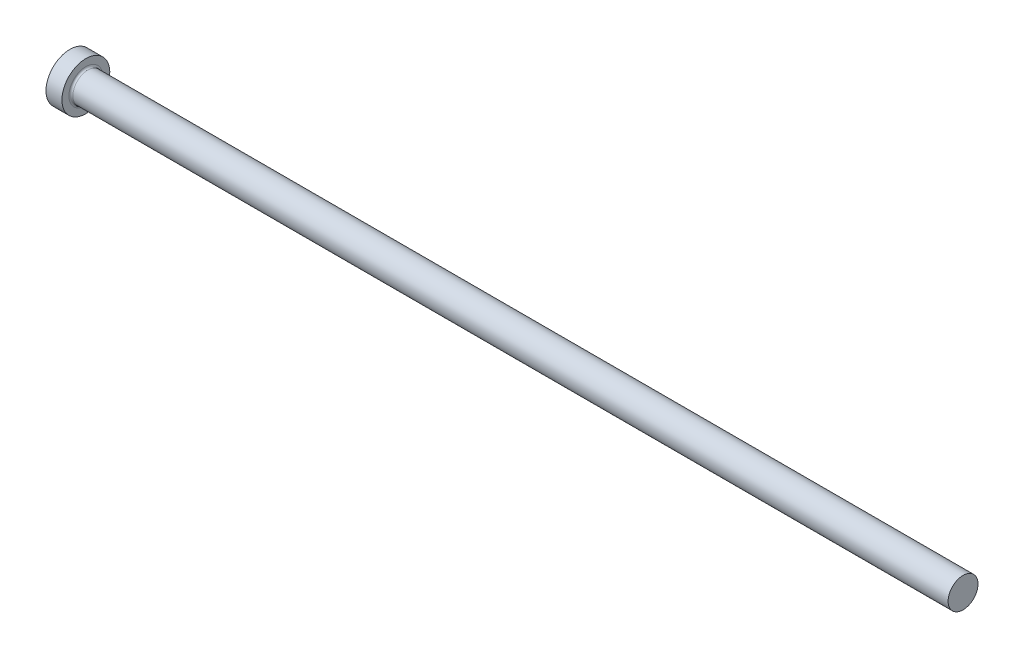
from build123d import *


with BuildPart() as part:
    # Sketch1 → PIN (revolve)
    with BuildSketch(Plane.XY, mode=Mode.PRIVATE) as pin_sk:
        with BuildLine():
            Line((0, 0), (0, 9.525))
            Line((0, 9.525), (6.35, 9.525))
            Line((6.35, 9.525), (6.35, 6.73989))
            ThreePointArc((6.35, 6.73989), (6.58062412, 6.18311412), (7.1374, 5.95249))
            Line((7.1374, 5.95249), (355.6, 5.95249))
            Line((355.6, 5.95249), (355.6, 0))
            Line((355.6, 0), (0, 0))
        make_face()
    revolve(pin_sk.sketch.rotate(Axis((355.6, 0, 0), (-1, 0, 0)), 180), axis=Axis((355.6, 0, 0), (-1, 0, 0)))


solid = part.part
